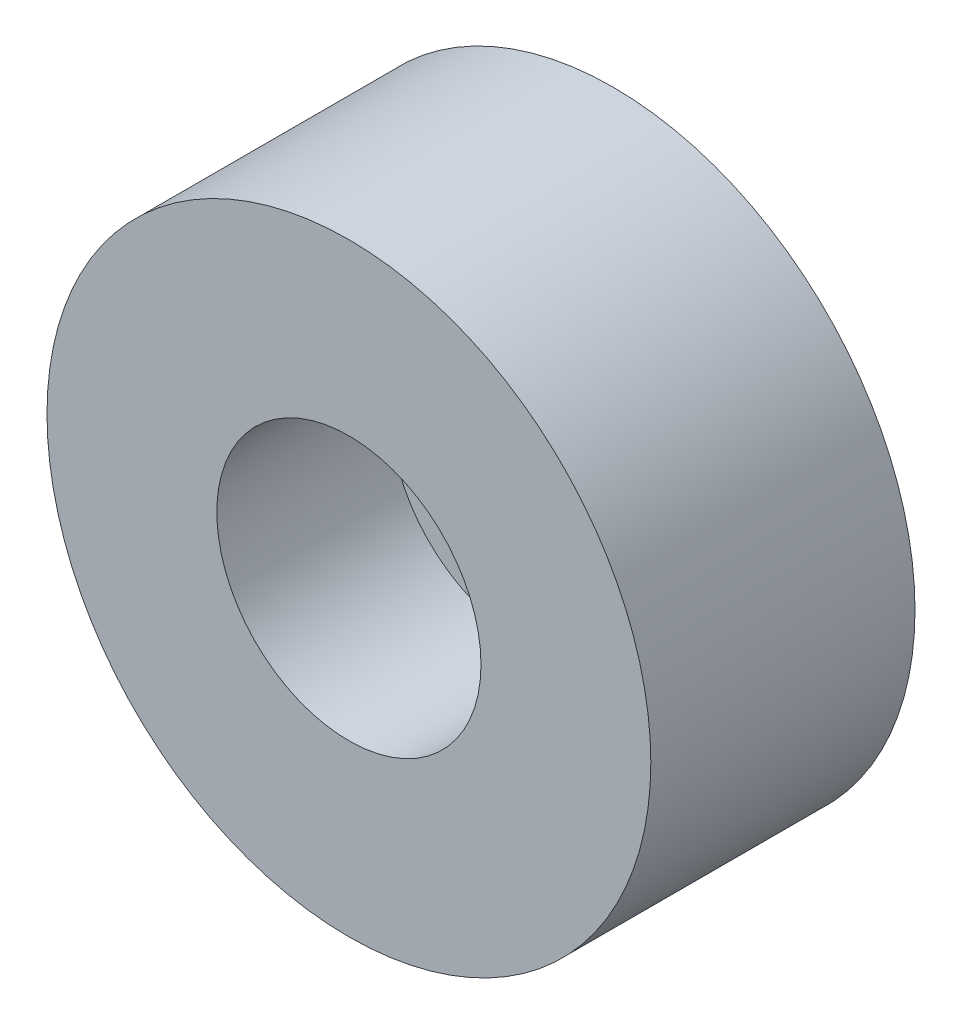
from build123d import *

# Parameters (mm, degrees)
SKETCH1_R           = 10.16
BOSS_EXTRUDE1_DEPTH = 8.89
SKETCH2_R           = 4.445
CUT_EXTRUDE1_DEPTH  = 5.842
SKETCH3_R           = 1.651
CUT_EXTRUDE2_DEPTH  = 3.048


with BuildPart() as part:
    # Sketch1 → Boss-Extrude1 (new body)
    with BuildSketch(Plane.XY):
        Circle(SKETCH1_R)
    extrude(amount=BOSS_EXTRUDE1_DEPTH)

    # Sketch2 → Cut-Extrude1 (cut)
    with BuildSketch(Plane.XY.offset(8.89)):
        Circle(SKETCH2_R)
    extrude(amount=-CUT_EXTRUDE1_DEPTH, mode=Mode.SUBTRACT)

    # Sketch3 → Cut-Extrude2 (cut)
    with BuildSketch(Plane.XY.offset(3.048)):
        Circle(SKETCH3_R)
    extrude(amount=-CUT_EXTRUDE2_DEPTH, mode=Mode.SUBTRACT)


solid = part.part
